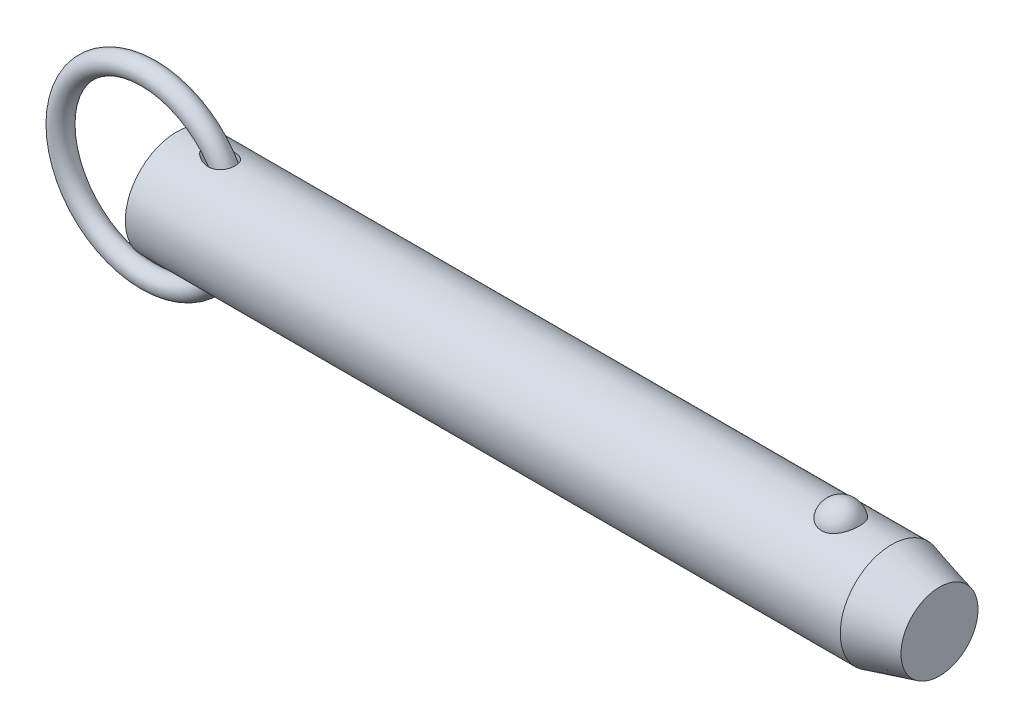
ISO-10303-21;
HEADER;
FILE_DESCRIPTION(('STEP AP214'),'2;1');
FILE_NAME('part.step','',(''),(''),'','','');
FILE_SCHEMA(('AUTOMOTIVE_DESIGN { 1 0 10303 214 1 1 1 1 }'));
ENDSEC;
DATA;
#1=APPLICATION_CONTEXT('core data for automotive mechanical design processes');
#2=APPLICATION_PROTOCOL_DEFINITION('international standard','automotive_design',2000,#1);
#3=PRODUCT_CONTEXT('',#1,'mechanical');
#4=PRODUCT('Part','Part','',(#3));
#5=PRODUCT_RELATED_PRODUCT_CATEGORY('part','',(#4));
#6=PRODUCT_DEFINITION_FORMATION('','',#4);
#7=PRODUCT_DEFINITION_CONTEXT('part definition',#1,'design');
#8=PRODUCT_DEFINITION('design','',#6,#7);
#9=PRODUCT_DEFINITION_SHAPE('','',#8);
#10=(LENGTH_UNIT() NAMED_UNIT(*) SI_UNIT(.MILLI.,.METRE.));
#11=(NAMED_UNIT(*) PLANE_ANGLE_UNIT() SI_UNIT($,.RADIAN.));
#12=(NAMED_UNIT(*) SI_UNIT($,.STERADIAN.) SOLID_ANGLE_UNIT());
#13=UNCERTAINTY_MEASURE_WITH_UNIT(LENGTH_MEASURE(1.E-05),#10,'distance_accuracy_value','');
#14=(GEOMETRIC_REPRESENTATION_CONTEXT(3) GLOBAL_UNCERTAINTY_ASSIGNED_CONTEXT((#13)) GLOBAL_UNIT_ASSIGNED_CONTEXT((#10,
#11,#12)) REPRESENTATION_CONTEXT('',''));
#15=CARTESIAN_POINT('',(0.,0.,0.));
#16=DIRECTION('',(0.,0.,1.));
#17=DIRECTION('',(1.,0.,0.));
#18=AXIS2_PLACEMENT_3D('',#15,#16,#17);
#19=CARTESIAN_POINT('',(-6.08699288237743,0.,0.));
#20=DIRECTION('',(0.,0.,1.));
#21=DIRECTION('',(1.,0.,0.));
#22=AXIS2_PLACEMENT_3D('',#19,#20,#21);
#23=TOROIDAL_SURFACE('',#22,19.05,2.223);
#24=CARTESIAN_POINT('',(15.1860071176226,0.,0.));
#25=VERTEX_POINT('',#24);
#26=VERTEX_LOOP('',#25);
#27=FACE_BOUND('',#26,.T.);
#28=ADVANCED_FACE('P0_F12',(#27),#23,.T.);
#29=CLOSED_SHELL('',(#28));
#30=MANIFOLD_SOLID_BREP('P0_B1',#29);
#31=CARTESIAN_POINT('',(0.,0.,0.));
#32=DIRECTION('',(1.,0.,0.));
#33=DIRECTION('',(0.,0.,-1.));
#34=AXIS2_PLACEMENT_3D('',#31,#32,#33);
#35=CYLINDRICAL_SURFACE('',#34,11.115);
#36=CARTESIAN_POINT('',(6.41405181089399,11.0227946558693,-1.4287136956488));
#37=CARTESIAN_POINT('',(6.49338916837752,11.0115377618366,-1.51556642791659));
#38=CARTESIAN_POINT('',(6.5776546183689,10.9998263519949,-1.59789397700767));
#39=CARTESIAN_POINT('',(6.75386647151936,10.9760304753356,-1.75391400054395));
#40=CARTESIAN_POINT('',(6.84582247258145,10.9639455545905,-1.82759540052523));
#41=CARTESIAN_POINT('',(7.03627827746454,10.9397989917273,-1.96698954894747));
#42=CARTESIAN_POINT('',(7.1348083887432,10.9277377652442,-2.03266078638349));
#43=CARTESIAN_POINT('',(7.33681032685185,10.9041015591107,-2.1558582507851));
#44=CARTESIAN_POINT('',(7.44028007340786,10.8925263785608,-2.21338786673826));
#45=CARTESIAN_POINT('',(7.64386117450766,10.8710104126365,-2.31666528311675));
#46=CARTESIAN_POINT('',(7.74368989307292,10.8610119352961,-2.36295942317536));
#47=CARTESIAN_POINT('',(7.94637195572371,10.8420168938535,-2.44863486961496));
#48=CARTESIAN_POINT('',(8.0492261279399,10.8330206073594,-2.48801426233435));
#49=CARTESIAN_POINT('',(8.3611557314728,10.807980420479,-2.59542730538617));
#50=CARTESIAN_POINT('',(8.57411849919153,10.7938278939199,-2.65299817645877));
#51=CARTESIAN_POINT('',(9.00825016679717,10.7725818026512,-2.73800108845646));
#52=CARTESIAN_POINT('',(9.22947335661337,10.7655491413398,-2.76517330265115));
#53=CARTESIAN_POINT('',(9.6736814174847,10.7605872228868,-2.78445308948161));
#54=CARTESIAN_POINT('',(9.89666486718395,10.7626512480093,-2.77658653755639));
#55=CARTESIAN_POINT('',(10.2950172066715,10.7754452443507,-2.72644436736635));
#56=CARTESIAN_POINT('',(10.4712789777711,10.7844280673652,-2.69109376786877));
#57=CARTESIAN_POINT('',(10.7292776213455,10.8024982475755,-2.61722365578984));
#58=CARTESIAN_POINT('',(10.8142337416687,10.8092901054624,-2.58911576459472));
#59=CARTESIAN_POINT('',(10.9813218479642,10.8242580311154,-2.52581287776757));
#60=CARTESIAN_POINT('',(11.0634550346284,10.8324335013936,-2.49062094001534));
#61=CARTESIAN_POINT('',(11.2247418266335,10.8500287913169,-2.41281958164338));
#62=CARTESIAN_POINT('',(11.3038694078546,10.8594572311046,-2.37015806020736));
#63=CARTESIAN_POINT('',(11.4576781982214,10.8792243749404,-2.27770403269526));
#64=CARTESIAN_POINT('',(11.5323615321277,10.8895626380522,-2.22791497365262));
#65=CARTESIAN_POINT('',(11.6765388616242,10.9108113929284,-2.12140590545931));
#66=CARTESIAN_POINT('',(11.7460329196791,10.9217218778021,-2.06468597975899));
#67=CARTESIAN_POINT('',(11.8790597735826,10.9437207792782,-1.94471764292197));
#68=CARTESIAN_POINT('',(11.9425932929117,10.9548091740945,-1.88147002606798));
#69=CARTESIAN_POINT('',(12.109388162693,10.9851999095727,-1.69784918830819));
#70=CARTESIAN_POINT('',(12.205655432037,11.0042655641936,-1.57093023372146));
#71=CARTESIAN_POINT('',(12.374151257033,11.0393391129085,-1.3017676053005));
#72=CARTESIAN_POINT('',(12.4463875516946,11.0553479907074,-1.15952888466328));
#73=CARTESIAN_POINT('',(12.5615818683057,11.0816338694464,-0.871972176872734));
#74=CARTESIAN_POINT('',(12.6058896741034,11.0921698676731,-0.727217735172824));
#75=CARTESIAN_POINT('',(12.6699315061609,11.1075802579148,-0.432089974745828));
#76=CARTESIAN_POINT('',(12.6896681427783,11.1124552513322,-0.281717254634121));
#77=CARTESIAN_POINT('',(12.704022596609,11.1159901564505,0.0188164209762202));
#78=CARTESIAN_POINT('',(12.6988836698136,11.1147102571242,0.168965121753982));
#79=CARTESIAN_POINT('',(12.6641681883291,11.1062126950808,0.466238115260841));
#80=CARTESIAN_POINT('',(12.6345920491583,11.0989951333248,0.61336245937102));
#81=CARTESIAN_POINT('',(12.5517453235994,11.0794095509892,0.900330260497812));
#82=CARTESIAN_POINT('',(12.4984878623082,11.0670443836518,1.0401777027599));
#83=CARTESIAN_POINT('',(12.3696588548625,11.0385082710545,1.308745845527));
#84=CARTESIAN_POINT('',(12.2940887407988,11.0223375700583,1.43746725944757));
#85=CARTESIAN_POINT('',(12.122380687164,10.987872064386,1.68079704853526));
#86=CARTESIAN_POINT('',(12.0261637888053,10.969569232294,1.79534850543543));
#87=CARTESIAN_POINT('',(11.8161707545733,10.932836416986,2.00695695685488));
#88=CARTESIAN_POINT('',(11.7023941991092,10.9144064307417,2.10401353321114));
#89=CARTESIAN_POINT('',(11.4575656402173,10.8788057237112,2.28105326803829));
#90=CARTESIAN_POINT('',(11.3261451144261,10.8616794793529,2.36053412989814));
#91=CARTESIAN_POINT('',(11.0523589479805,10.8308019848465,2.49839044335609));
#92=CARTESIAN_POINT('',(10.9099908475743,10.8170514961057,2.55676113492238));
#93=CARTESIAN_POINT('',(10.6060622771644,10.7929728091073,2.65666105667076));
#94=CARTESIAN_POINT('',(10.4438877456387,10.7830209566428,2.69640163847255));
#95=CARTESIAN_POINT('',(10.1154037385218,10.7687230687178,2.75293129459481));
#96=CARTESIAN_POINT('',(9.94909141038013,10.7643810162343,2.76970406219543));
#97=CARTESIAN_POINT('',(9.54387061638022,10.7604809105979,2.7848723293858));
#98=CARTESIAN_POINT('',(9.30446860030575,10.7637793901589,2.77227753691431));
#99=CARTESIAN_POINT('',(8.94961255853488,10.7757341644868,2.72524141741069));
#100=CARTESIAN_POINT('',(8.83186896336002,10.7808994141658,2.70482239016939));
#101=CARTESIAN_POINT('',(8.59835142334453,10.7932548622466,2.65509992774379));
#102=CARTESIAN_POINT('',(8.48257728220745,10.8004448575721,2.62579738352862));
#103=CARTESIAN_POINT('',(8.25208469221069,10.8166382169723,2.55827624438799));
#104=CARTESIAN_POINT('',(8.1374021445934,10.8256649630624,2.51994155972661));
#105=CARTESIAN_POINT('',(7.91132058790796,10.8451170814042,2.43486475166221));
#106=CARTESIAN_POINT('',(7.79992154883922,10.8555424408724,2.38812270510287));
#107=CARTESIAN_POINT('',(7.58115677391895,10.8774251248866,2.28638483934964));
#108=CARTESIAN_POINT('',(7.47378802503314,10.8888816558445,2.23139534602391));
#109=CARTESIAN_POINT('',(7.26385624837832,10.9124540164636,2.11310265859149));
#110=CARTESIAN_POINT('',(7.16129168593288,10.9245696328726,2.04980214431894));
#111=CARTESIAN_POINT('',(6.91882218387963,10.9543689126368,1.88540538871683));
#112=CARTESIAN_POINT('',(6.78193778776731,10.9721958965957,1.77979827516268));
#113=CARTESIAN_POINT('',(6.52472441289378,11.0070222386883,1.54989693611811));
#114=CARTESIAN_POINT('',(6.40436902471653,11.0240228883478,1.42563320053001));
#115=CARTESIAN_POINT('',(6.21838804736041,11.0509658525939,1.19529359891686));
#116=CARTESIAN_POINT('',(6.14691885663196,11.0615430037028,1.09404520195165));
#117=CARTESIAN_POINT('',(6.0204349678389,11.0805004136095,0.881508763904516));
#118=CARTESIAN_POINT('',(5.96539400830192,11.0888841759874,0.770237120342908));
#119=CARTESIAN_POINT('',(5.88475453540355,11.1012553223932,0.560577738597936));
#120=CARTESIAN_POINT('',(5.85559643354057,11.1057686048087,0.463603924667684));
#121=CARTESIAN_POINT('',(5.81381299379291,11.1122523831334,0.266083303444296));
#122=CARTESIAN_POINT('',(5.80117118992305,11.1142254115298,0.165540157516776));
#123=CARTESIAN_POINT('',(5.79363815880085,11.1153999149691,-0.0364747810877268));
#124=CARTESIAN_POINT('',(5.79878799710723,11.1145949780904,-0.137948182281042));
#125=CARTESIAN_POINT('',(5.82639592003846,11.1102987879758,-0.338493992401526));
#126=CARTESIAN_POINT('',(5.8488723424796,11.1068046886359,-0.437563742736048));
#127=CARTESIAN_POINT('',(5.91510741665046,11.0965857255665,-0.649968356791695));
#128=CARTESIAN_POINT('',(5.96220905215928,11.0893566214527,-0.7622229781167));
#129=CARTESIAN_POINT('',(6.0737844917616,11.072471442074,-0.977396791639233));
#130=CARTESIAN_POINT('',(6.13826787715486,11.0628140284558,-1.08031079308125));
#131=CARTESIAN_POINT('',(6.24101077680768,11.0477136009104,-1.2219580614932));
#132=CARTESIAN_POINT('',(6.27403486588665,11.042895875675,-1.26469183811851));
#133=CARTESIAN_POINT('',(6.34238022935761,11.0330152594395,-1.34817011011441));
#134=CARTESIAN_POINT('',(6.37769867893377,11.0279526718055,-1.38891694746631));
#135=CARTESIAN_POINT('',(6.41405181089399,11.0227946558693,-1.4287136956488));
#136=B_SPLINE_CURVE_WITH_KNOTS('',3,(#36,#37,#38,#39,#40,#41,#42,#43,#44,#45,#46,#47,#48,#49,
#50,#51,#52,#53,#54,#55,#56,#57,#58,#59,#60,#61,#62,#63,#64,#65,#66,#67,#68,#69,#70,#71,#72,#73,
#74,#75,#76,#77,#78,#79,#80,#81,#82,#83,#84,#85,#86,#87,#88,#89,#90,#91,#92,#93,#94,#95,#96,#97,
#98,#99,#100,#101,#102,#103,#104,#105,#106,#107,#108,#109,#110,#111,#112,#113,#114,#115,#116,
#117,#118,#119,#120,#121,#122,#123,#124,#125,#126,#127,#128,#129,#130,#131,#132,#133,#134,#135),
.UNSPECIFIED.,.T.,.F.,(4,2,2,2,2,2,2,2,2,2,2,2,2,2,2,2,2,2,2,2,2,2,2,2,2,2,2,2,2,2,2,2,2,2,2,2,
2,2,2,2,2,2,2,2,2,2,2,2,2,4),(0.,0.354433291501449,0.709315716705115,1.0659654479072,
1.42246628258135,1.75367157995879,2.08496839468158,2.74582009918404,3.41227815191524,
4.07824412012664,4.61583787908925,4.88478112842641,5.1536085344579,5.42439170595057,
5.69504436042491,5.96569375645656,6.23631025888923,6.71490729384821,7.19335005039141,
7.64641437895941,8.09943057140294,8.54802575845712,8.99661331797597,9.44495256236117,
9.89326303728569,10.3433195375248,10.7933867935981,11.2550086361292,11.7167345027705,
12.2165866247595,12.7167934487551,13.4318876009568,13.7904664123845,14.1490092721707,
14.5124394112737,14.8758662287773,15.239015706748,15.6020483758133,16.1219860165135,
16.6410830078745,17.0130520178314,17.3844231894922,17.6872330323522,17.9897407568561,
18.2929471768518,18.5964749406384,18.9603532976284,19.3244326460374,19.4870338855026,
19.649438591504),.UNSPECIFIED.);
#137=CARTESIAN_POINT('',(6.41405181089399,11.0227946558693,-1.4287136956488));
#138=VERTEX_POINT('',#137);
#139=EDGE_CURVE('P1_E40',#138,#138,#136,.T.);
#140=ORIENTED_EDGE('',*,*,#139,.T.);
#141=EDGE_LOOP('',(#140));
#142=FACE_BOUND('',#141,.T.);
#143=CARTESIAN_POINT('',(154.729563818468,0.,0.));
#144=DIRECTION('',(1.,0.,0.));
#145=DIRECTION('',(0.,0.,-1.));
#146=AXIS2_PLACEMENT_3D('',#143,#144,#145);
#147=CIRCLE('',#146,11.115);
#148=CARTESIAN_POINT('',(154.729563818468,0.,-11.115));
#149=VERTEX_POINT('',#148);
#150=EDGE_CURVE('P1_E25',#149,#149,#147,.T.);
#151=ORIENTED_EDGE('',*,*,#150,.F.);
#152=EDGE_LOOP('',(#151));
#153=FACE_BOUND('',#152,.T.);
#154=CARTESIAN_POINT('',(0.,0.,0.));
#155=DIRECTION('',(1.,0.,0.));
#156=DIRECTION('',(0.,0.,-1.));
#157=AXIS2_PLACEMENT_3D('',#154,#155,#156);
#158=CIRCLE('',#157,11.115);
#159=CARTESIAN_POINT('',(0.,0.,-11.115));
#160=VERTEX_POINT('',#159);
#161=EDGE_CURVE('P1_E9',#160,#160,#158,.T.);
#162=ORIENTED_EDGE('',*,*,#161,.T.);
#163=EDGE_LOOP('',(#162));
#164=FACE_BOUND('',#163,.T.);
#165=CARTESIAN_POINT('',(143.731068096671,10.3028087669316,4.17077409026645));
#166=CARTESIAN_POINT('',(143.514775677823,10.3028003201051,4.17078240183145));
#167=CARTESIAN_POINT('',(143.298548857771,10.3098895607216,4.15340593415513));
#168=CARTESIAN_POINT('',(142.872540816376,10.3373834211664,4.08449540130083));
#169=CARTESIAN_POINT('',(142.662757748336,10.3577841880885,4.0329712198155));
#170=CARTESIAN_POINT('',(142.255782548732,10.4095237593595,3.89746513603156));
#171=CARTESIAN_POINT('',(142.058572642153,10.4408466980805,3.81353029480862));
#172=CARTESIAN_POINT('',(141.681338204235,10.5110236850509,3.61560339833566));
#173=CARTESIAN_POINT('',(141.501317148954,10.5498792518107,3.50160528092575));
#174=CARTESIAN_POINT('',(141.157684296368,10.6322884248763,3.24292464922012));
#175=CARTESIAN_POINT('',(140.994686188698,10.6759443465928,3.09746040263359));
#176=CARTESIAN_POINT('',(140.694591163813,10.7625291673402,2.78171925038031));
#177=CARTESIAN_POINT('',(140.557499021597,10.8054579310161,2.61143778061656));
#178=CARTESIAN_POINT('',(140.306408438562,10.8881935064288,2.24226695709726));
#179=CARTESIAN_POINT('',(140.193710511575,10.9277761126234,2.04244123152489));
#180=CARTESIAN_POINT('',(140.001777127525,10.997484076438,1.62578254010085));
#181=CARTESIAN_POINT('',(139.922544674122,11.0276085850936,1.40894804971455));
#182=CARTESIAN_POINT('',(139.798303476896,11.0756732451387,0.961250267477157));
#183=CARTESIAN_POINT('',(139.753760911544,11.0934470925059,0.730239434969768));
#184=CARTESIAN_POINT('',(139.701569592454,11.1143331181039,0.263439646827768));
#185=CARTESIAN_POINT('',(139.693920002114,11.1174456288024,0.0276507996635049));
#186=CARTESIAN_POINT('',(139.71561056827,11.1087161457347,-0.440729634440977));
#187=CARTESIAN_POINT('',(139.744762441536,11.0969502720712,-0.673331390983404));
#188=CARTESIAN_POINT('',(139.839143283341,11.0597872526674,-1.12996621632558));
#189=CARTESIAN_POINT('',(139.904372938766,11.0343898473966,-1.35399912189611));
#190=CARTESIAN_POINT('',(140.06969844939,10.972515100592,-1.78750286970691));
#191=CARTESIAN_POINT('',(140.16983863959,10.9360236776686,-1.99695478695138));
#192=CARTESIAN_POINT('',(140.402940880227,10.8557595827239,-2.39520667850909));
#193=CARTESIAN_POINT('',(140.535905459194,10.8119863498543,-2.58400506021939));
#194=CARTESIAN_POINT('',(140.832407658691,10.7216733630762,-2.93635726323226));
#195=CARTESIAN_POINT('',(140.996056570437,10.675123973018,-3.09981510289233));
#196=CARTESIAN_POINT('',(141.349860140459,10.5846571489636,-3.39592247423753));
#197=CARTESIAN_POINT('',(141.540012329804,10.5407394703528,-3.52857487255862));
#198=CARTESIAN_POINT('',(141.93750141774,10.4616690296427,-3.75646057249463));
#199=CARTESIAN_POINT('',(142.14436705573,10.4263443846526,-3.85245432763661));
#200=CARTESIAN_POINT('',(142.572954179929,10.3675574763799,-4.00798747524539));
#201=CARTESIAN_POINT('',(142.794670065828,10.3440907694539,-4.06754052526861));
#202=CARTESIAN_POINT('',(143.234669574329,10.3128282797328,-4.14614314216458));
#203=CARTESIAN_POINT('',(143.452565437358,10.3043040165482,-4.1670783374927));
#204=CARTESIAN_POINT('',(143.88894951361,10.3016771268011,-4.17357158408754));
#205=CARTESIAN_POINT('',(144.107437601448,10.3075716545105,-4.15913661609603));
#206=CARTESIAN_POINT('',(144.531744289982,10.3326686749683,-4.09636961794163));
#207=CARTESIAN_POINT('',(144.737745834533,10.3514555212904,-4.0490957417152));
#208=CARTESIAN_POINT('',(145.138576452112,10.399818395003,-3.92320197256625));
#209=CARTESIAN_POINT('',(145.3334046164,10.4293952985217,-3.84457953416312));
#210=CARTESIAN_POINT('',(145.711191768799,10.4969600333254,-3.65612410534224));
#211=CARTESIAN_POINT('',(145.893797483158,10.5351178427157,-3.54564545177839));
#212=CARTESIAN_POINT('',(146.238204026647,10.6154999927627,-3.29718036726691));
#213=CARTESIAN_POINT('',(146.400000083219,10.657725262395,-3.15918764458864));
#214=CARTESIAN_POINT('',(146.706959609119,10.744212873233,-2.85163580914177));
#215=CARTESIAN_POINT('',(146.850891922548,10.7884718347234,-2.68084605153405));
#216=CARTESIAN_POINT('',(147.109237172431,10.872374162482,-2.31721864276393));
#217=CARTESIAN_POINT('',(147.223644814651,10.9120167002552,-2.12437704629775));
#218=CARTESIAN_POINT('',(147.423873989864,10.9838919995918,-1.71516999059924));
#219=CARTESIAN_POINT('',(147.50866178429,11.0158465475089,-1.49824866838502));
#220=CARTESIAN_POINT('',(147.64268382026,11.0673523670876,-1.05228572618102));
#221=CARTESIAN_POINT('',(147.691917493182,11.086903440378,-0.82324391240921));
#222=CARTESIAN_POINT('',(147.753891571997,11.1116323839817,-0.359087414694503));
#223=CARTESIAN_POINT('',(147.766566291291,11.1167843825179,-0.123962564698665));
#224=CARTESIAN_POINT('',(147.754973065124,11.1121144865,0.345220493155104));
#225=CARTESIAN_POINT('',(147.730705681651,11.1022928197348,0.579278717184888));
#226=CARTESIAN_POINT('',(147.645907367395,11.0687504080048,1.03866534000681));
#227=CARTESIAN_POINT('',(147.585529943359,11.0450885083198,1.26402641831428));
#228=CARTESIAN_POINT('',(147.429853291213,10.9863185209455,1.70076772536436));
#229=CARTESIAN_POINT('',(147.334551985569,10.9512097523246,1.91214712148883));
#230=CARTESIAN_POINT('',(147.110397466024,10.8729733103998,2.316083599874));
#231=CARTESIAN_POINT('',(146.981380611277,10.8298068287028,2.50854240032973));
#232=CARTESIAN_POINT('',(146.692732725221,10.7401896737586,2.86808766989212));
#233=CARTESIAN_POINT('',(146.533102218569,10.6937390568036,3.03517457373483));
#234=CARTESIAN_POINT('',(146.187534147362,10.6029321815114,3.33857581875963));
#235=CARTESIAN_POINT('',(146.001708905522,10.5585680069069,3.47501541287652));
#236=CARTESIAN_POINT('',(145.607875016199,10.4769321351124,3.71390897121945));
#237=CARTESIAN_POINT('',(145.399863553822,10.439661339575,3.81635861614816));
#238=CARTESIAN_POINT('',(144.954066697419,10.3749407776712,3.98910631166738));
#239=CARTESIAN_POINT('',(144.715234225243,10.3482457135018,4.05700929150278));
#240=CARTESIAN_POINT('',(144.227925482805,10.312188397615,4.14782844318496));
#241=CARTESIAN_POINT('',(143.979453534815,10.3028184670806,4.17076454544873));
#242=CARTESIAN_POINT('',(143.731068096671,10.3028087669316,4.17077409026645));
#243=B_SPLINE_CURVE_WITH_KNOTS('',3,(#165,#166,#167,#168,#169,#170,#171,#172,#173,#174,#175,
#176,#177,#178,#179,#180,#181,#182,#183,#184,#185,#186,#187,#188,#189,#190,#191,#192,#193,#194,
#195,#196,#197,#198,#199,#200,#201,#202,#203,#204,#205,#206,#207,#208,#209,#210,#211,#212,#213,
#214,#215,#216,#217,#218,#219,#220,#221,#222,#223,#224,#225,#226,#227,#228,#229,#230,#231,#232,
#233,#234,#235,#236,#237,#238,#239,#240,#241,#242),.UNSPECIFIED.,.T.,.F.,(4,2,2,2,2,2,2,2,2,2,2,
2,2,2,2,2,2,2,2,2,2,2,2,2,2,2,2,2,2,2,2,2,2,2,2,2,2,2,4),(0.,0.64796614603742,1.29574482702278,
1.9425864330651,2.58955857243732,3.25496465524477,3.92049326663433,4.61566368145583,
5.31089647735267,6.01531821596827,6.71972398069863,7.42054043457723,8.12137023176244,
8.82309331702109,9.5248704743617,10.2292439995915,10.9335519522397,11.6223330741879,
12.3108558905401,12.9647664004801,13.6185478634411,14.252184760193,14.8858731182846,
15.5334360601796,16.1811472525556,16.8611459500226,17.5412664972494,18.2431855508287,
18.9451158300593,19.6483065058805,20.3514864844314,21.0516982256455,21.7519516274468,
22.4556690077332,23.1593743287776,23.8601491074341,24.5610129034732,25.3054529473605,
26.049562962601),.UNSPECIFIED.);
#244=CARTESIAN_POINT('',(143.731068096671,10.3028087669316,4.17077409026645));
#245=VERTEX_POINT('',#244);
#246=EDGE_CURVE('P1_E34',#245,#245,#243,.T.);
#247=ORIENTED_EDGE('',*,*,#246,.T.);
#248=EDGE_LOOP('',(#247));
#249=FACE_BOUND('',#248,.T.);
#250=CARTESIAN_POINT('',(6.41405181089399,-11.0227946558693,-1.4287136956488));
#251=CARTESIAN_POINT('',(6.3312406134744,-11.0345445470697,-1.33806125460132));
#252=CARTESIAN_POINT('',(6.25372866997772,-11.0458090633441,-1.24240732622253));
#253=CARTESIAN_POINT('',(6.11277905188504,-11.0666115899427,-1.04095704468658));
#254=CARTESIAN_POINT('',(6.04933920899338,-11.0761498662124,-0.935162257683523));
#255=CARTESIAN_POINT('',(5.94029181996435,-11.0927063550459,-0.712476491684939));
#256=CARTESIAN_POINT('',(5.89492964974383,-11.0996897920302,-0.595457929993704));
#257=CARTESIAN_POINT('',(5.84498161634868,-11.1074141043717,-0.414997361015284));
#258=CARTESIAN_POINT('',(5.83135004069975,-11.1095300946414,-0.354047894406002));
#259=CARTESIAN_POINT('',(5.81051649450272,-11.1127688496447,-0.231041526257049));
#260=CARTESIAN_POINT('',(5.80331311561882,-11.1138918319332,-0.1689848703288));
#261=CARTESIAN_POINT('',(5.7929652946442,-11.1155042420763,-0.000484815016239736));
#262=CARTESIAN_POINT('',(5.79625267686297,-11.1149904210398,0.106437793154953));
#263=CARTESIAN_POINT('',(5.82213676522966,-11.1109609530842,0.317809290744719));
#264=CARTESIAN_POINT('',(5.84474662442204,-11.1074432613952,0.422256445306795));
#265=CARTESIAN_POINT('',(5.911131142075,-11.097197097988,0.63936180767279));
#266=CARTESIAN_POINT('',(5.95733120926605,-11.090102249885,0.751250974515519));
#267=CARTESIAN_POINT('',(6.06709542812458,-11.0734770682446,0.965912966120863));
#268=CARTESIAN_POINT('',(6.13068735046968,-11.06394284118,1.06867085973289));
#269=CARTESIAN_POINT('',(6.30294237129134,-11.0385920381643,1.30890635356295));
#270=CARTESIAN_POINT('',(6.41896200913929,-11.0218881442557,1.44097376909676));
#271=CARTESIAN_POINT('',(6.66989654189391,-10.9871512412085,1.68553954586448));
#272=CARTESIAN_POINT('',(6.80485520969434,-10.9691152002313,1.79799117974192));
#273=CARTESIAN_POINT('',(7.04881236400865,-10.9382283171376,1.97587596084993));
#274=CARTESIAN_POINT('',(7.15465712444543,-10.9253240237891,2.04570822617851));
#275=CARTESIAN_POINT('',(7.37202504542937,-10.9000987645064,2.17611840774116));
#276=CARTESIAN_POINT('',(7.48355057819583,-10.8877780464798,2.23669241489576));
#277=CARTESIAN_POINT('',(7.71132418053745,-10.8641580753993,2.34873831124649));
#278=CARTESIAN_POINT('',(7.82757727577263,-10.8528599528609,2.40020018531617));
#279=CARTESIAN_POINT('',(8.06386825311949,-10.8317234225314,2.49385169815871));
#280=CARTESIAN_POINT('',(8.18390558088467,-10.8218848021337,2.53604268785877));
#281=CARTESIAN_POINT('',(8.42918336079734,-10.8039208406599,2.61152283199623));
#282=CARTESIAN_POINT('',(8.55447802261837,-10.7958283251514,2.64464414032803));
#283=CARTESIAN_POINT('',(8.8075212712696,-10.781995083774,2.70048793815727));
#284=CARTESIAN_POINT('',(8.93527019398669,-10.7762546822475,2.72320899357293));
#285=CARTESIAN_POINT('',(9.19210176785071,-10.7675291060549,2.75750994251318));
#286=CARTESIAN_POINT('',(9.32118105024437,-10.7645381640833,2.76911315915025));
#287=CARTESIAN_POINT('',(9.57984338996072,-10.761622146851,2.78042035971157));
#288=CARTESIAN_POINT('',(9.70942621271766,-10.7616957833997,2.78012934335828));
#289=CARTESIAN_POINT('',(10.0243125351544,-10.7659059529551,2.76381534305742));
#290=CARTESIAN_POINT('',(10.209307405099,-10.7717977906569,2.74099674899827));
#291=CARTESIAN_POINT('',(10.5731188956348,-10.7905408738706,2.66626238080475));
#292=CARTESIAN_POINT('',(10.7519389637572,-10.8033881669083,2.61436313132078));
#293=CARTESIAN_POINT('',(11.0114289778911,-10.8271584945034,2.51336808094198));
#294=CARTESIAN_POINT('',(11.096831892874,-10.835881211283,2.47562331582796));
#295=CARTESIAN_POINT('',(11.2636000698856,-10.8545688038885,2.39236170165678));
#296=CARTESIAN_POINT('',(11.3449673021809,-10.8645330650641,2.3468486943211));
#297=CARTESIAN_POINT('',(11.5027832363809,-10.8853818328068,2.24815967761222));
#298=CARTESIAN_POINT('',(11.5792327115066,-10.8962661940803,2.19498487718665));
#299=CARTESIAN_POINT('',(11.7263315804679,-10.9185541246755,2.08128855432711));
#300=CARTESIAN_POINT('',(11.7969818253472,-10.9299576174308,2.02076811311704));
#301=CARTESIAN_POINT('',(11.9817953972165,-10.9613645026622,1.84513663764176));
#302=CARTESIAN_POINT('',(12.0893012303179,-10.9814643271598,1.72286660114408));
#303=CARTESIAN_POINT('',(12.2803576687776,-11.0193991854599,1.46066991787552));
#304=CARTESIAN_POINT('',(12.3639173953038,-11.0372350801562,1.3207500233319));
#305=CARTESIAN_POINT('',(12.4996220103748,-11.0672969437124,1.03778067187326));
#306=CARTESIAN_POINT('',(12.5535315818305,-11.0798242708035,0.895607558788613));
#307=CARTESIAN_POINT('',(12.636874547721,-11.0995427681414,0.603918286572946));
#308=CARTESIAN_POINT('',(12.6663115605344,-11.1067347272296,0.454403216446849));
#309=CARTESIAN_POINT('',(12.6997387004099,-11.1149224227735,0.154577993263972));
#310=CARTESIAN_POINT('',(12.7040886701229,-11.1160057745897,0.00431019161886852));
#311=CARTESIAN_POINT('',(12.6882048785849,-11.1120956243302,-0.294841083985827));
#312=CARTESIAN_POINT('',(12.6679715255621,-11.1071022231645,-0.443724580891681));
#313=CARTESIAN_POINT('',(12.6034470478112,-11.0915888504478,-0.735688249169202));
#314=CARTESIAN_POINT('',(12.5591858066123,-11.0810757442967,-0.878775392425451));
#315=CARTESIAN_POINT('',(12.4477416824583,-11.0556687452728,-1.15529525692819));
#316=CARTESIAN_POINT('',(12.3805601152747,-11.0407751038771,-1.2887285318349));
#317=CARTESIAN_POINT('',(12.2248919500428,-11.0081839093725,-1.54257976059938));
#318=CARTESIAN_POINT('',(12.1363549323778,-10.9904797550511,-1.66296592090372));
#319=CARTESIAN_POINT('',(11.9406137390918,-10.9541951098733,-1.88726577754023));
#320=CARTESIAN_POINT('',(11.833409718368,-10.9356146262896,-1.99117961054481));
#321=CARTESIAN_POINT('',(11.601318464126,-10.8991360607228,-2.18213646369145));
#322=CARTESIAN_POINT('',(11.4761325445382,-10.8812577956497,-2.26881927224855));
#323=CARTESIAN_POINT('',(11.2134852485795,-10.8482871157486,-2.42157282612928));
#324=CARTESIAN_POINT('',(11.0760218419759,-10.8331951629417,-2.48764015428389));
#325=CARTESIAN_POINT('',(10.7828968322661,-10.8061050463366,-2.60290068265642));
#326=CARTESIAN_POINT('',(10.6266338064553,-10.7943907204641,-2.65062248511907));
#327=CARTESIAN_POINT('',(10.3086617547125,-10.7762429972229,-2.72345054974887));
#328=CARTESIAN_POINT('',(10.146948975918,-10.7698133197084,-2.74854088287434));
#329=CARTESIAN_POINT('',(9.75541304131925,-10.7608036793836,-2.78368719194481));
#330=CARTESIAN_POINT('',(9.52459435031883,-10.7608467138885,-2.78350276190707));
#331=CARTESIAN_POINT('',(9.0660496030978,-10.7702674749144,-2.74677945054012));
#332=CARTESIAN_POINT('',(8.83832966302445,-10.7796615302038,-2.71017697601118));
#333=CARTESIAN_POINT('',(8.38783466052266,-10.8058248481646,-2.60392490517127));
#334=CARTESIAN_POINT('',(8.16517101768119,-10.8226939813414,-2.53382676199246));
#335=CARTESIAN_POINT('',(7.84087311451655,-10.8516548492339,-2.40555545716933));
#336=CARTESIAN_POINT('',(7.73435551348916,-10.8619221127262,-2.35892455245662));
#337=CARTESIAN_POINT('',(7.52510420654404,-10.883357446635,-2.25797017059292));
#338=CARTESIAN_POINT('',(7.42236986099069,-10.8945253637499,-2.20364800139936));
#339=CARTESIAN_POINT('',(7.23808758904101,-10.915528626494,-2.09688018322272));
#340=CARTESIAN_POINT('',(7.15584631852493,-10.9252787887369,-2.04561072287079));
#341=CARTESIAN_POINT('',(6.99510576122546,-10.944960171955,-1.93754729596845));
#342=CARTESIAN_POINT('',(6.91660574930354,-10.9548913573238,-1.88075440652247));
#343=CARTESIAN_POINT('',(6.76418133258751,-10.974690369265,-1.7615450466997));
#344=CARTESIAN_POINT('',(6.69024940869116,-10.984558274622,-1.69913825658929));
#345=CARTESIAN_POINT('',(6.54780119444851,-11.0039826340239,-1.56842485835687));
#346=CARTESIAN_POINT('',(6.47928247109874,-11.0135392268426,-1.50012092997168));
#347=CARTESIAN_POINT('',(6.41405181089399,-11.0227946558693,-1.4287136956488));
#348=B_SPLINE_CURVE_WITH_KNOTS('',3,(#250,#251,#252,#253,#254,#255,#256,#257,#258,#259,#260,
#261,#262,#263,#264,#265,#266,#267,#268,#269,#270,#271,#272,#273,#274,#275,#276,#277,#278,#279,
#280,#281,#282,#283,#284,#285,#286,#287,#288,#289,#290,#291,#292,#293,#294,#295,#296,#297,#298,
#299,#300,#301,#302,#303,#304,#305,#306,#307,#308,#309,#310,#311,#312,#313,#314,#315,#316,#317,
#318,#319,#320,#321,#322,#323,#324,#325,#326,#327,#328,#329,#330,#331,#332,#333,#334,#335,#336,
#337,#338,#339,#340,#341,#342,#343,#344,#345,#346,#347),.UNSPECIFIED.,.T.,.F.,(4,2,2,2,2,2,2,2,
2,2,2,2,2,2,2,2,2,2,2,2,2,2,2,2,2,2,2,2,2,2,2,2,2,2,2,2,2,2,2,2,2,2,2,2,2,2,2,2,4),(0.,
0.36983565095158,0.739614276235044,1.1142538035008,1.30141910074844,1.48854338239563,
1.8074587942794,2.12659146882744,2.4883888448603,2.85076733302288,3.3776216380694,
3.90571433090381,4.287639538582,4.66972556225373,5.05222896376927,5.43467659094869,
5.82378546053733,6.21294796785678,6.6012922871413,6.98947336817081,7.54669558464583,
8.10360148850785,8.38458539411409,8.66543074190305,8.94623182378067,9.22699162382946,
9.7162888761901,10.2053995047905,10.6608871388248,11.1163074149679,11.5651786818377,
12.0140424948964,12.4623493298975,12.9106304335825,13.3599804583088,13.8093267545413,
14.2672570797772,14.7252632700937,15.214740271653,15.7045615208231,16.3932594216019,
17.083162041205,17.7825738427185,18.1325177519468,18.4824022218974,18.7744056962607,
19.0663523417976,19.3578048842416,19.6491256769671),.UNSPECIFIED.);
#349=CARTESIAN_POINT('',(6.41405181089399,-11.0227946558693,-1.4287136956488));
#350=VERTEX_POINT('',#349);
#351=EDGE_CURVE('P1_E17',#350,#350,#348,.T.);
#352=ORIENTED_EDGE('',*,*,#351,.T.);
#353=EDGE_LOOP('',(#352));
#354=FACE_BOUND('',#353,.T.);
#355=ADVANCED_FACE('P1_F13',(#142,#153,#164,#249,#354),#35,.T.);
#356=CARTESIAN_POINT('',(0.,0.,0.));
#357=DIRECTION('',(-1.,0.,0.));
#358=DIRECTION('',(0.,0.,1.));
#359=AXIS2_PLACEMENT_3D('',#356,#357,#358);
#360=PLANE('',#359);
#361=ORIENTED_EDGE('',*,*,#161,.F.);
#362=EDGE_LOOP('',(#361));
#363=FACE_BOUND('',#362,.T.);
#364=ADVANCED_FACE('P1_F15',(#363),#360,.T.);
#365=CARTESIAN_POINT('',(165.1,0.,0.));
#366=DIRECTION('',(-1.,0.,0.));
#367=DIRECTION('',(0.,0.,1.));
#368=AXIS2_PLACEMENT_3D('',#365,#366,#367);
#369=CONICAL_SURFACE('',#368,8.33625000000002,0.26179938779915);
#370=ORIENTED_EDGE('',*,*,#150,.T.);
#371=EDGE_LOOP('',(#370));
#372=FACE_BOUND('',#371,.T.);
#373=CARTESIAN_POINT('',(165.1,0.,0.));
#374=DIRECTION('',(1.,0.,0.));
#375=DIRECTION('',(0.,0.,-1.));
#376=AXIS2_PLACEMENT_3D('',#373,#374,#375);
#377=CIRCLE('',#376,8.33625000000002);
#378=CARTESIAN_POINT('',(165.1,0.,-8.33625000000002));
#379=VERTEX_POINT('',#378);
#380=EDGE_CURVE('P1_E30',#379,#379,#377,.T.);
#381=ORIENTED_EDGE('',*,*,#380,.F.);
#382=EDGE_LOOP('',(#381));
#383=FACE_BOUND('',#382,.T.);
#384=ADVANCED_FACE('P1_F55',(#372,#383),#369,.T.);
#385=CARTESIAN_POINT('',(165.1,8.33625000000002,0.));
#386=DIRECTION('',(1.,0.,0.));
#387=DIRECTION('',(0.,0.,-1.));
#388=AXIS2_PLACEMENT_3D('',#385,#386,#387);
#389=PLANE('',#388);
#390=ORIENTED_EDGE('',*,*,#380,.T.);
#391=EDGE_LOOP('',(#390));
#392=FACE_BOUND('',#391,.T.);
#393=ADVANCED_FACE('P1_F51',(#392),#389,.T.);
#394=CARTESIAN_POINT('',(143.731068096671,10.0035,0.));
#395=DIRECTION('',(-1.,0.,0.));
#396=DIRECTION('',(0.,-1.,0.));
#397=AXIS2_PLACEMENT_3D('',#394,#395,#396);
#398=SPHERICAL_SURFACE('',#397,4.18150000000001);
#399=ORIENTED_EDGE('',*,*,#246,.F.);
#400=EDGE_LOOP('',(#399));
#401=FACE_BOUND('',#400,.T.);
#402=ADVANCED_FACE('P1_F46',(#401),#398,.T.);
#403=CARTESIAN_POINT('',(-6.08699288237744,0.,0.));
#404=DIRECTION('',(0.,0.,1.));
#405=DIRECTION('',(1.,0.,0.));
#406=AXIS2_PLACEMENT_3D('',#403,#404,#405);
#407=TOROIDAL_SURFACE('',#406,19.05,2.77875);
#408=ORIENTED_EDGE('',*,*,#351,.F.);
#409=EDGE_LOOP('',(#408));
#410=FACE_BOUND('',#409,.T.);
#411=ORIENTED_EDGE('',*,*,#139,.F.);
#412=EDGE_LOOP('',(#411));
#413=FACE_BOUND('',#412,.T.);
#414=ADVANCED_FACE('P1_F50',(#410,#413),#407,.F.);
#415=CLOSED_SHELL('',(#355,#364,#384,#393,#402,#414));
#416=MANIFOLD_SOLID_BREP('P1_B1',#415);
#417=ADVANCED_BREP_SHAPE_REPRESENTATION('',(#18,#30,#416),#14);
#418=SHAPE_DEFINITION_REPRESENTATION(#9,#417);
ENDSEC;
END-ISO-10303-21;
